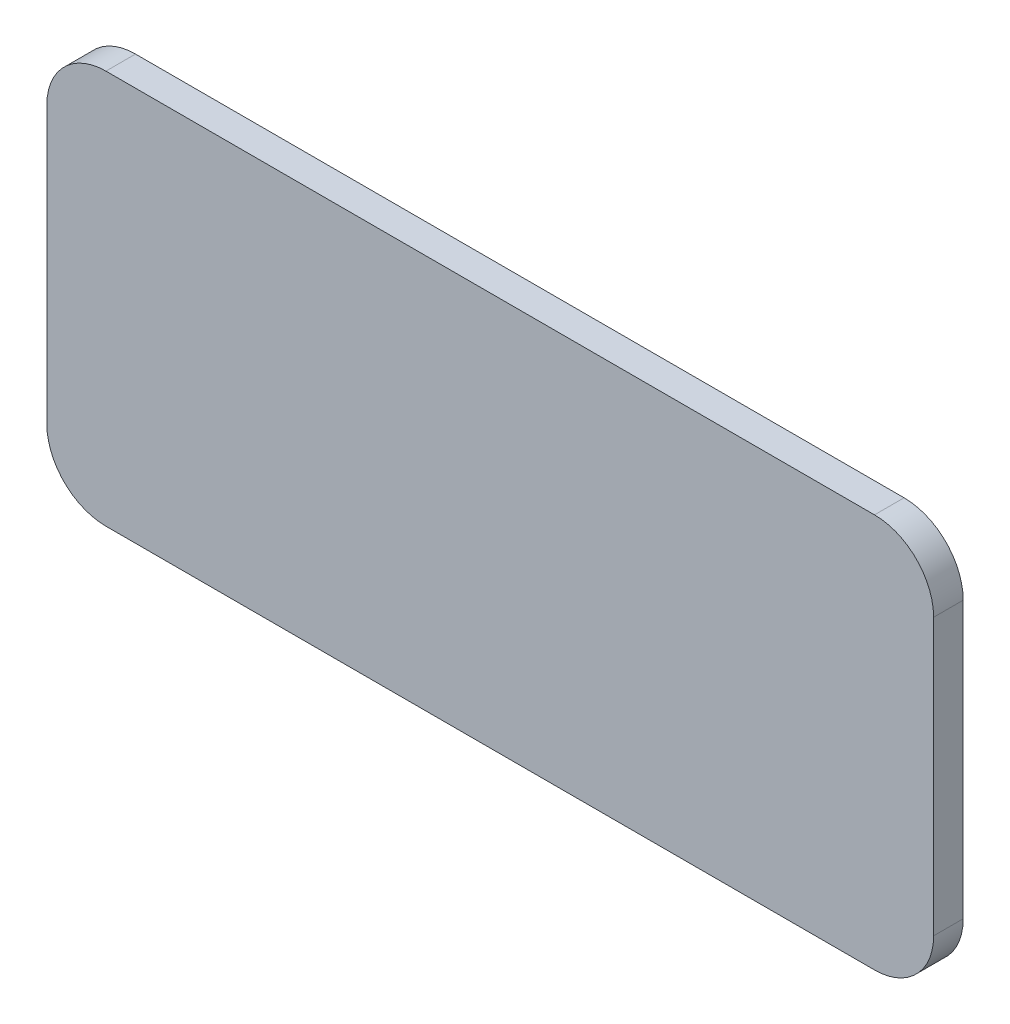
from build123d import *

# Parameters (mm, degrees)
SALIENTE_EXTRUIR1_DEPTH = 1.5


with BuildPart() as part:
    # Croquis1 → Saliente-Extruir1 (new body)
    with BuildSketch(Plane.XY):
        with BuildLine():
            Line((55, 34.5), (55, 20.5))
            ThreePointArc((55, 20.5), (55.878679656, 18.378679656), (58, 17.5))
            Line((58, 17.5), (97, 17.5))
            ThreePointArc((97, 17.5), (99.121320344, 18.378679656), (100, 20.5))
            Line((100, 20.5), (100, 34.5))
            ThreePointArc((100, 34.5), (99.121320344, 36.621320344), (97, 37.5))
            Line((97, 37.5), (58, 37.5))
            ThreePointArc((58, 37.5), (55.878679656, 36.621320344), (55, 34.5))
        make_face()
    extrude(amount=SALIENTE_EXTRUIR1_DEPTH)


solid = part.part
